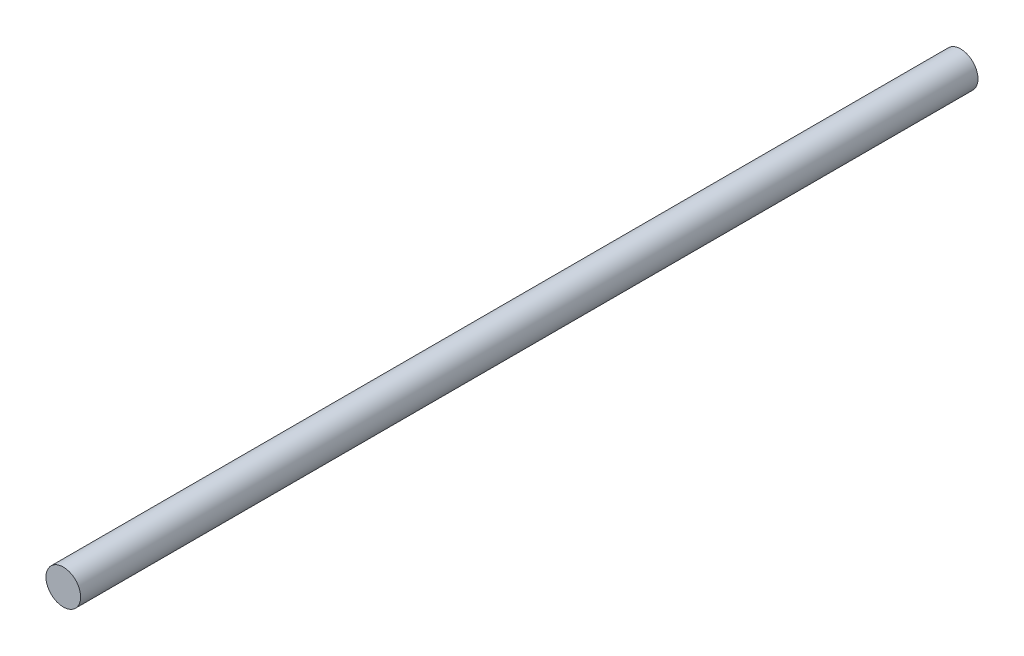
from build123d import *

# Parameters (mm, degrees)
SKETCH1_R           = 8.001
BOSS_EXTRUDE1_DEPTH = 414.3375


with BuildPart() as part:
    # Sketch1 → Boss-Extrude1 (new body)
    with BuildSketch(Plane.XY):
        Circle(SKETCH1_R)
    extrude(amount=BOSS_EXTRUDE1_DEPTH)


solid = part.part
